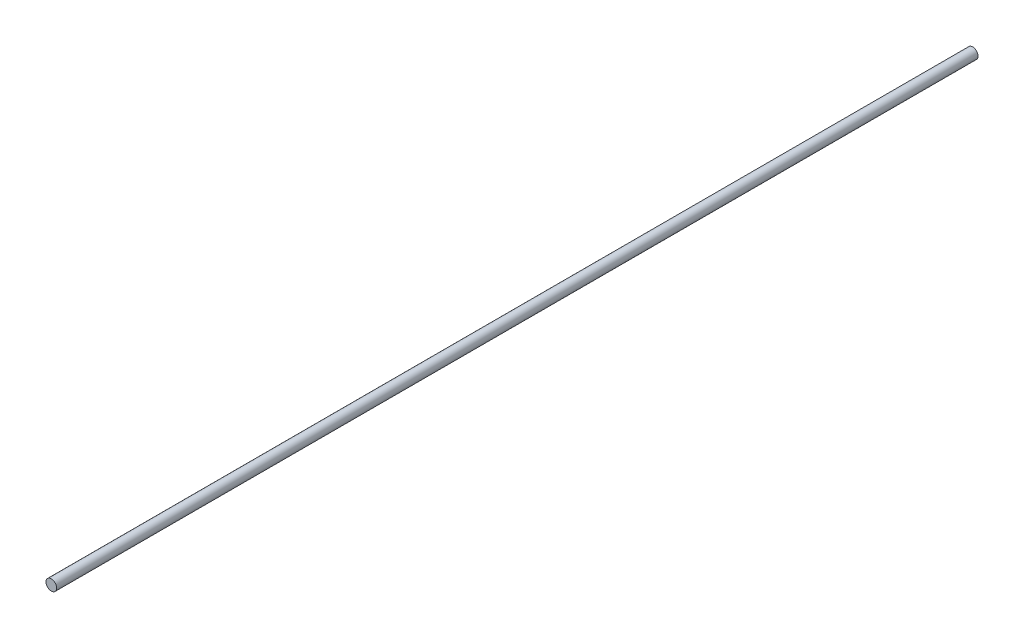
from build123d import *

# Parameters (mm, degrees)
SKETCH1_R           = 30
BOSS_EXTRUDE1_DEPTH = 5200


with BuildPart() as part:
    # Sketch1 → Boss-Extrude1 (new body)
    with BuildSketch(Plane.XY):
        Circle(SKETCH1_R)
    extrude(amount=-BOSS_EXTRUDE1_DEPTH)


solid = part.part
